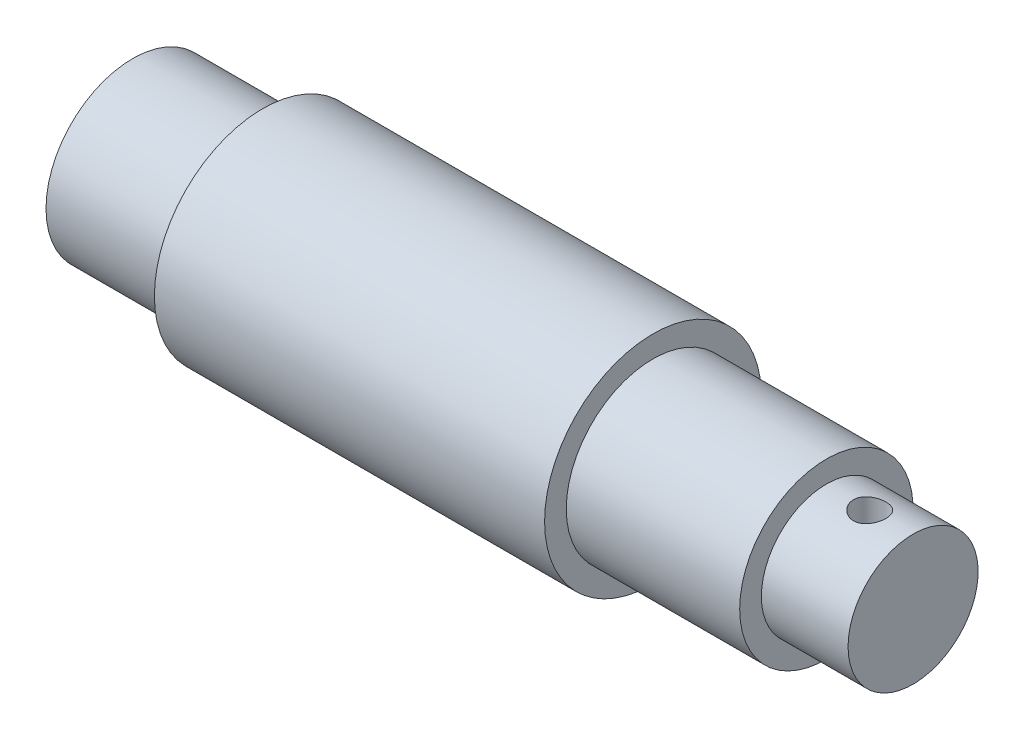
ISO-10303-21;
HEADER;
FILE_DESCRIPTION(('STEP AP214'),'2;1');
FILE_NAME('part.step','',(''),(''),'','','');
FILE_SCHEMA(('AUTOMOTIVE_DESIGN { 1 0 10303 214 1 1 1 1 }'));
ENDSEC;
DATA;
#1=APPLICATION_CONTEXT('core data for automotive mechanical design processes');
#2=APPLICATION_PROTOCOL_DEFINITION('international standard','automotive_design',2000,#1);
#3=PRODUCT_CONTEXT('',#1,'mechanical');
#4=PRODUCT('Part','Part','',(#3));
#5=PRODUCT_RELATED_PRODUCT_CATEGORY('part','',(#4));
#6=PRODUCT_DEFINITION_FORMATION('','',#4);
#7=PRODUCT_DEFINITION_CONTEXT('part definition',#1,'design');
#8=PRODUCT_DEFINITION('design','',#6,#7);
#9=PRODUCT_DEFINITION_SHAPE('','',#8);
#10=(LENGTH_UNIT() NAMED_UNIT(*) SI_UNIT(.MILLI.,.METRE.));
#11=(NAMED_UNIT(*) PLANE_ANGLE_UNIT() SI_UNIT($,.RADIAN.));
#12=(NAMED_UNIT(*) SI_UNIT($,.STERADIAN.) SOLID_ANGLE_UNIT());
#13=UNCERTAINTY_MEASURE_WITH_UNIT(LENGTH_MEASURE(1.E-05),#10,'distance_accuracy_value','');
#14=(GEOMETRIC_REPRESENTATION_CONTEXT(3) GLOBAL_UNCERTAINTY_ASSIGNED_CONTEXT((#13)) GLOBAL_UNIT_ASSIGNED_CONTEXT((#10,
#11,#12)) REPRESENTATION_CONTEXT('',''));
#15=CARTESIAN_POINT('',(0.,0.,0.));
#16=DIRECTION('',(0.,0.,1.));
#17=DIRECTION('',(1.,0.,0.));
#18=AXIS2_PLACEMENT_3D('',#15,#16,#17);
#19=CARTESIAN_POINT('',(0.,0.,0.));
#20=DIRECTION('',(1.,0.,0.));
#21=DIRECTION('',(0.,0.,-1.));
#22=AXIS2_PLACEMENT_3D('',#19,#20,#21);
#23=PLANE('',#22);
#24=CARTESIAN_POINT('',(0.,0.,0.));
#25=DIRECTION('',(-1.,0.,0.));
#26=DIRECTION('',(0.,0.,1.));
#27=AXIS2_PLACEMENT_3D('',#24,#25,#26);
#28=CIRCLE('',#27,6.35);
#29=CARTESIAN_POINT('',(0.,0.,6.35));
#30=VERTEX_POINT('',#29);
#31=EDGE_CURVE('E10',#30,#30,#28,.T.);
#32=ORIENTED_EDGE('',*,*,#31,.T.);
#33=EDGE_LOOP('',(#32));
#34=FACE_BOUND('',#33,.T.);
#35=ADVANCED_FACE('F32',(#34),#23,.F.);
#36=CARTESIAN_POINT('',(0.,0.,0.));
#37=DIRECTION('',(-1.,0.,0.));
#38=DIRECTION('',(0.,0.,1.));
#39=AXIS2_PLACEMENT_3D('',#36,#37,#38);
#40=CYLINDRICAL_SURFACE('',#39,6.35);
#41=ORIENTED_EDGE('',*,*,#31,.F.);
#42=EDGE_LOOP('',(#41));
#43=FACE_BOUND('',#42,.T.);
#44=CARTESIAN_POINT('',(9.525,0.,0.));
#45=DIRECTION('',(-1.,0.,0.));
#46=DIRECTION('',(0.,0.,1.));
#47=AXIS2_PLACEMENT_3D('',#44,#45,#46);
#48=CIRCLE('',#47,6.35);
#49=CARTESIAN_POINT('',(9.525,0.,6.35));
#50=VERTEX_POINT('',#49);
#51=EDGE_CURVE('E43',#50,#50,#48,.T.);
#52=ORIENTED_EDGE('',*,*,#51,.T.);
#53=EDGE_LOOP('',(#52));
#54=FACE_BOUND('',#53,.T.);
#55=ADVANCED_FACE('F74',(#43,#54),#40,.T.);
#56=CARTESIAN_POINT('',(9.525,7.93749999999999,0.));
#57=DIRECTION('',(1.,0.,0.));
#58=DIRECTION('',(0.,0.,-1.));
#59=AXIS2_PLACEMENT_3D('',#56,#57,#58);
#60=PLANE('',#59);
#61=ORIENTED_EDGE('',*,*,#51,.F.);
#62=EDGE_LOOP('',(#61));
#63=FACE_BOUND('',#62,.T.);
#64=CARTESIAN_POINT('',(9.525,0.,0.));
#65=DIRECTION('',(-1.,0.,0.));
#66=DIRECTION('',(0.,0.,1.));
#67=AXIS2_PLACEMENT_3D('',#64,#65,#66);
#68=CIRCLE('',#67,7.93749999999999);
#69=CARTESIAN_POINT('',(9.525,0.,7.93749999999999));
#70=VERTEX_POINT('',#69);
#71=EDGE_CURVE('E48',#70,#70,#68,.T.);
#72=ORIENTED_EDGE('',*,*,#71,.T.);
#73=EDGE_LOOP('',(#72));
#74=FACE_BOUND('',#73,.T.);
#75=ADVANCED_FACE('F78',(#63,#74),#60,.F.);
#76=CARTESIAN_POINT('',(0.,0.,0.));
#77=DIRECTION('',(-1.,0.,0.));
#78=DIRECTION('',(0.,0.,1.));
#79=AXIS2_PLACEMENT_3D('',#76,#77,#78);
#80=CYLINDRICAL_SURFACE('',#79,7.9375);
#81=ORIENTED_EDGE('',*,*,#71,.F.);
#82=EDGE_LOOP('',(#81));
#83=FACE_BOUND('',#82,.T.);
#84=CARTESIAN_POINT('',(38.1,0.,0.));
#85=DIRECTION('',(-1.,0.,0.));
#86=DIRECTION('',(0.,0.,1.));
#87=AXIS2_PLACEMENT_3D('',#84,#85,#86);
#88=CIRCLE('',#87,7.9375);
#89=CARTESIAN_POINT('',(38.1,0.,7.9375));
#90=VERTEX_POINT('',#89);
#91=EDGE_CURVE('E119',#90,#90,#88,.T.);
#92=ORIENTED_EDGE('',*,*,#91,.T.);
#93=EDGE_LOOP('',(#92));
#94=FACE_BOUND('',#93,.T.);
#95=ADVANCED_FACE('F83',(#83,#94),#80,.T.);
#96=CARTESIAN_POINT('',(38.1,6.35,0.));
#97=DIRECTION('',(-1.,0.,0.));
#98=DIRECTION('',(0.,0.,1.));
#99=AXIS2_PLACEMENT_3D('',#96,#97,#98);
#100=PLANE('',#99);
#101=ORIENTED_EDGE('',*,*,#91,.F.);
#102=EDGE_LOOP('',(#101));
#103=FACE_BOUND('',#102,.T.);
#104=CARTESIAN_POINT('',(38.1,0.,0.));
#105=DIRECTION('',(-1.,0.,0.));
#106=DIRECTION('',(0.,0.,1.));
#107=AXIS2_PLACEMENT_3D('',#104,#105,#106);
#108=CIRCLE('',#107,6.35);
#109=CARTESIAN_POINT('',(38.1,0.,6.35));
#110=VERTEX_POINT('',#109);
#111=EDGE_CURVE('E112',#110,#110,#108,.T.);
#112=ORIENTED_EDGE('',*,*,#111,.T.);
#113=EDGE_LOOP('',(#112));
#114=FACE_BOUND('',#113,.T.);
#115=ADVANCED_FACE('F90',(#103,#114),#100,.F.);
#116=CARTESIAN_POINT('',(0.,0.,0.));
#117=DIRECTION('',(-1.,0.,0.));
#118=DIRECTION('',(0.,0.,1.));
#119=AXIS2_PLACEMENT_3D('',#116,#117,#118);
#120=CYLINDRICAL_SURFACE('',#119,6.35);
#121=ORIENTED_EDGE('',*,*,#111,.F.);
#122=EDGE_LOOP('',(#121));
#123=FACE_BOUND('',#122,.T.);
#124=CARTESIAN_POINT('',(50.8,0.,0.));
#125=DIRECTION('',(-1.,0.,0.));
#126=DIRECTION('',(0.,0.,1.));
#127=AXIS2_PLACEMENT_3D('',#124,#125,#126);
#128=CIRCLE('',#127,6.35);
#129=CARTESIAN_POINT('',(50.8,0.,6.35));
#130=VERTEX_POINT('',#129);
#131=EDGE_CURVE('E105',#130,#130,#128,.T.);
#132=ORIENTED_EDGE('',*,*,#131,.T.);
#133=EDGE_LOOP('',(#132));
#134=FACE_BOUND('',#133,.T.);
#135=ADVANCED_FACE('F94',(#123,#134),#120,.T.);
#136=CARTESIAN_POINT('',(50.8,6.35,0.));
#137=DIRECTION('',(-1.,0.,0.));
#138=DIRECTION('',(0.,0.,1.));
#139=AXIS2_PLACEMENT_3D('',#136,#137,#138);
#140=PLANE('',#139);
#141=ORIENTED_EDGE('',*,*,#131,.F.);
#142=EDGE_LOOP('',(#141));
#143=FACE_BOUND('',#142,.T.);
#144=CARTESIAN_POINT('',(50.8,0.,0.));
#145=DIRECTION('',(-1.,0.,0.));
#146=DIRECTION('',(0.,0.,1.));
#147=AXIS2_PLACEMENT_3D('',#144,#145,#146);
#148=CIRCLE('',#147,4.7625);
#149=CARTESIAN_POINT('',(50.8,0.,4.7625));
#150=VERTEX_POINT('',#149);
#151=EDGE_CURVE('E108',#150,#150,#148,.T.);
#152=ORIENTED_EDGE('',*,*,#151,.T.);
#153=EDGE_LOOP('',(#152));
#154=FACE_BOUND('',#153,.T.);
#155=ADVANCED_FACE('F70',(#143,#154),#140,.F.);
#156=CARTESIAN_POINT('',(0.,0.,0.));
#157=DIRECTION('',(-1.,0.,0.));
#158=DIRECTION('',(0.,0.,1.));
#159=AXIS2_PLACEMENT_3D('',#156,#157,#158);
#160=CYLINDRICAL_SURFACE('',#159,4.7625);
#161=CARTESIAN_POINT('',(53.975,-4.61127079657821,1.190625));
#162=CARTESIAN_POINT('',(54.0407466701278,-4.61127205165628,1.19062313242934));
#163=CARTESIAN_POINT('',(54.1065140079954,-4.61269225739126,1.18516062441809));
#164=CARTESIAN_POINT('',(54.2361600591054,-4.61820511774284,1.1634897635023));
#165=CARTESIAN_POINT('',(54.3000376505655,-4.62229932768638,1.14727515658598));
#166=CARTESIAN_POINT('',(54.4240101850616,-4.63266817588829,1.10465768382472));
#167=CARTESIAN_POINT('',(54.4841098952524,-4.63893999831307,1.0782679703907));
#168=CARTESIAN_POINT('',(54.5990355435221,-4.6529538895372,1.01608944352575));
#169=CARTESIAN_POINT('',(54.6538612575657,-4.66069602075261,0.980300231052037));
#170=CARTESIAN_POINT('',(54.7578891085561,-4.6769689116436,0.899497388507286));
#171=CARTESIAN_POINT('',(54.8069580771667,-4.68551227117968,0.85431481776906));
#172=CARTESIAN_POINT('',(54.8969063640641,-4.7023156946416,0.756371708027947));
#173=CARTESIAN_POINT('',(54.9377849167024,-4.71057573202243,0.703610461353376));
#174=CARTESIAN_POINT('',(55.0107368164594,-4.72602122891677,0.591095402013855));
#175=CARTESIAN_POINT('',(55.0426793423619,-4.73319008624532,0.531254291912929));
#176=CARTESIAN_POINT('',(55.0960018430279,-4.7455017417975,0.406842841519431));
#177=CARTESIAN_POINT('',(55.1173833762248,-4.75064483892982,0.342273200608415));
#178=CARTESIAN_POINT('',(55.1485504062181,-4.75823641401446,0.211625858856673));
#179=CARTESIAN_POINT('',(55.1585620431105,-4.76073736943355,0.145605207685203));
#180=CARTESIAN_POINT('',(55.16741492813,-4.76294574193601,0.0127772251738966));
#181=CARTESIAN_POINT('',(55.1662578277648,-4.76265357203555,-0.0540299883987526));
#182=CARTESIAN_POINT('',(55.1529687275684,-4.75934767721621,-0.184966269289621));
#183=CARTESIAN_POINT('',(55.1410808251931,-4.75639448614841,-0.249121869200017));
#184=CARTESIAN_POINT('',(55.1070599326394,-4.74816885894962,-0.374497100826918));
#185=CARTESIAN_POINT('',(55.084926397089,-4.74289629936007,-0.435716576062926));
#186=CARTESIAN_POINT('',(55.0308450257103,-4.73053176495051,-0.554124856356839));
#187=CARTESIAN_POINT('',(54.9988103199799,-4.72342378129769,-0.611272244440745));
#188=CARTESIAN_POINT('',(54.9259018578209,-4.70815941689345,-0.719465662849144));
#189=CARTESIAN_POINT('',(54.885026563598,-4.70000285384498,-0.770510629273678));
#190=CARTESIAN_POINT('',(54.7942887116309,-4.68326968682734,-0.866505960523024));
#191=CARTESIAN_POINT('',(54.7442128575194,-4.67468768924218,-0.911253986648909));
#192=CARTESIAN_POINT('',(54.6371780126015,-4.65827289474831,-0.99176249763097));
#193=CARTESIAN_POINT('',(54.5802187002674,-4.65044013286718,-1.02752256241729));
#194=CARTESIAN_POINT('',(54.4606368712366,-4.63639136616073,-1.08916961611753));
#195=CARTESIAN_POINT('',(54.3979882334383,-4.63018338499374,-1.11500789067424));
#196=CARTESIAN_POINT('',(54.2690436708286,-4.62019002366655,-1.15572256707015));
#197=CARTESIAN_POINT('',(54.202748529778,-4.61640412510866,-1.17060131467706));
#198=CARTESIAN_POINT('',(54.0702692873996,-4.61179238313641,-1.18863886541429));
#199=CARTESIAN_POINT('',(54.0041285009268,-4.6108909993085,-1.19209683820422));
#200=CARTESIAN_POINT('',(53.8722148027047,-4.61194472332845,-1.18801371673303));
#201=CARTESIAN_POINT('',(53.8064418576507,-4.61389956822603,-1.18047363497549));
#202=CARTESIAN_POINT('',(53.6782418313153,-4.62037310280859,-1.15487075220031));
#203=CARTESIAN_POINT('',(53.6157776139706,-4.62484932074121,-1.13698213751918));
#204=CARTESIAN_POINT('',(53.4947345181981,-4.63582092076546,-1.09138311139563));
#205=CARTESIAN_POINT('',(53.4361561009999,-4.64231654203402,-1.0636715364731));
#206=CARTESIAN_POINT('',(53.3232798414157,-4.65675410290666,-0.998587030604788));
#207=CARTESIAN_POINT('',(53.2690885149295,-4.66472191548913,-0.961035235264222));
#208=CARTESIAN_POINT('',(53.1676665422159,-4.68114260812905,-0.877562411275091));
#209=CARTESIAN_POINT('',(53.1204370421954,-4.68959556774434,-0.831640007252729));
#210=CARTESIAN_POINT('',(53.0330674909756,-4.70629013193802,-0.731356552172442));
#211=CARTESIAN_POINT('',(52.9931343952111,-4.71452115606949,-0.676813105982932));
#212=CARTESIAN_POINT('',(52.9229942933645,-4.72962549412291,-0.561621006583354));
#213=CARTESIAN_POINT('',(52.8927867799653,-4.73649887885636,-0.500972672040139));
#214=CARTESIAN_POINT('',(52.8432175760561,-4.74807017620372,-0.375711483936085));
#215=CARTESIAN_POINT('',(52.8237778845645,-4.75278369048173,-0.311131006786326));
#216=CARTESIAN_POINT('',(52.7960620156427,-4.75957245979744,-0.179486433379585));
#217=CARTESIAN_POINT('',(52.7877836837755,-4.76164822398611,-0.112422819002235));
#218=CARTESIAN_POINT('',(52.7827467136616,-4.76290682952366,0.0203400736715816));
#219=CARTESIAN_POINT('',(52.7856826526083,-4.7621663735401,0.0860272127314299));
#220=CARTESIAN_POINT('',(52.8022913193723,-4.7580458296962,0.215940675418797));
#221=CARTESIAN_POINT('',(52.815963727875,-4.75466582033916,0.280167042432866));
#222=CARTESIAN_POINT('',(52.8534934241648,-4.74565780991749,0.405016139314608));
#223=CARTESIAN_POINT('',(52.8772954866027,-4.74004200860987,0.465656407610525));
#224=CARTESIAN_POINT('',(52.9343587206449,-4.72715378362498,0.582116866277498));
#225=CARTESIAN_POINT('',(52.9676210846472,-4.71988115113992,0.637936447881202));
#226=CARTESIAN_POINT('',(53.0435922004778,-4.70424569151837,0.744619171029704));
#227=CARTESIAN_POINT('',(53.0865081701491,-4.69586092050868,0.795331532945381));
#228=CARTESIAN_POINT('',(53.1801659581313,-4.67904491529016,0.888938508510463));
#229=CARTESIAN_POINT('',(53.2309097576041,-4.67061366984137,0.931831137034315));
#230=CARTESIAN_POINT('',(53.3399223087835,-4.65448025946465,1.00936666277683));
#231=CARTESIAN_POINT('',(53.3983137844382,-4.64679463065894,1.04384072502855));
#232=CARTESIAN_POINT('',(53.5202473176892,-4.63324522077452,1.10243171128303));
#233=CARTESIAN_POINT('',(53.5837855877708,-4.6273801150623,1.12655617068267));
#234=CARTESIAN_POINT('',(53.7018432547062,-4.61905241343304,1.16017182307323));
#235=CARTESIAN_POINT('',(53.7557977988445,-4.61615626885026,1.17156686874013));
#236=CARTESIAN_POINT('',(53.8648301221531,-4.61226501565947,1.18679391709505));
#237=CARTESIAN_POINT('',(53.9199078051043,-4.61126974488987,1.19062656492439));
#238=CARTESIAN_POINT('',(53.975,-4.61127079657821,1.190625));
#239=B_SPLINE_CURVE_WITH_KNOTS('',3,(#161,#162,#163,#164,#165,#166,#167,#168,#169,#170,#171,
#172,#173,#174,#175,#176,#177,#178,#179,#180,#181,#182,#183,#184,#185,#186,#187,#188,#189,#190,
#191,#192,#193,#194,#195,#196,#197,#198,#199,#200,#201,#202,#203,#204,#205,#206,#207,#208,#209,
#210,#211,#212,#213,#214,#215,#216,#217,#218,#219,#220,#221,#222,#223,#224,#225,#226,#227,#228,
#229,#230,#231,#232,#233,#234,#235,#236,#237,#238),.UNSPECIFIED.,.T.,.F.,(4,2,2,2,2,2,2,2,2,2,2,
2,2,2,2,2,2,2,2,2,2,2,2,2,2,2,2,2,2,2,2,2,2,2,2,2,2,2,4),(0.,0.197037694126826,0.3941900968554,
0.591088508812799,0.78799528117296,0.988809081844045,1.18964164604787,1.39327650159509,
1.59688129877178,1.79636142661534,1.99581205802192,2.19083697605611,2.3858722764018,
2.5826698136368,2.7795016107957,2.98166059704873,3.18382902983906,3.38697775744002,
3.59008299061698,3.78782377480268,3.98554635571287,4.18003389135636,4.37454447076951,
4.57287080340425,4.77122975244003,4.97455188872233,5.17786341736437,5.37968224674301,
5.5814621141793,5.77778616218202,5.97410437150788,6.16936572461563,6.36465169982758,
6.56461617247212,6.76463133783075,6.96837797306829,7.17197601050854,7.33709715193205,
7.50220420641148),.UNSPECIFIED.);
#240=CARTESIAN_POINT('',(53.975,-4.61127079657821,1.190625));
#241=VERTEX_POINT('',#240);
#242=EDGE_CURVE('E35',#241,#241,#239,.T.);
#243=ORIENTED_EDGE('',*,*,#242,.T.);
#244=EDGE_LOOP('',(#243));
#245=FACE_BOUND('',#244,.T.);
#246=CARTESIAN_POINT('',(53.975,4.61127079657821,1.190625));
#247=CARTESIAN_POINT('',(53.9092533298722,4.61127205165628,1.19062313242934));
#248=CARTESIAN_POINT('',(53.8434859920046,4.61269225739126,1.18516062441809));
#249=CARTESIAN_POINT('',(53.7138399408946,4.61820511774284,1.1634897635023));
#250=CARTESIAN_POINT('',(53.6499623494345,4.62229932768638,1.14727515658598));
#251=CARTESIAN_POINT('',(53.5259898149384,4.63266817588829,1.10465768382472));
#252=CARTESIAN_POINT('',(53.4658901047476,4.63893999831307,1.07826797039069));
#253=CARTESIAN_POINT('',(53.3509644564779,4.6529538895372,1.01608944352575));
#254=CARTESIAN_POINT('',(53.2961387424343,4.66069602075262,0.980300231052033));
#255=CARTESIAN_POINT('',(53.1921108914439,4.6769689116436,0.899497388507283));
#256=CARTESIAN_POINT('',(53.1430419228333,4.68551227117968,0.854314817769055));
#257=CARTESIAN_POINT('',(53.0530936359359,4.7023156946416,0.756371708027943));
#258=CARTESIAN_POINT('',(53.0122150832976,4.71057573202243,0.703610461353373));
#259=CARTESIAN_POINT('',(52.9392631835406,4.72602122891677,0.591095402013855));
#260=CARTESIAN_POINT('',(52.9073206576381,4.73319008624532,0.531254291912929));
#261=CARTESIAN_POINT('',(52.8539981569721,4.7455017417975,0.406842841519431));
#262=CARTESIAN_POINT('',(52.8326166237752,4.75064483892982,0.342273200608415));
#263=CARTESIAN_POINT('',(52.8014495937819,4.75823641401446,0.211625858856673));
#264=CARTESIAN_POINT('',(52.7914379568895,4.76073736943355,0.145605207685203));
#265=CARTESIAN_POINT('',(52.78258507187,4.76294574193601,0.0127772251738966));
#266=CARTESIAN_POINT('',(52.7837421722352,4.76265357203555,-0.0540299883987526));
#267=CARTESIAN_POINT('',(52.7970312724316,4.75934767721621,-0.184966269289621));
#268=CARTESIAN_POINT('',(52.8089191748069,4.75639448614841,-0.249121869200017));
#269=CARTESIAN_POINT('',(52.8429400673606,4.74816885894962,-0.374497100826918));
#270=CARTESIAN_POINT('',(52.865073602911,4.74289629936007,-0.435716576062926));
#271=CARTESIAN_POINT('',(52.9191549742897,4.73053176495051,-0.554124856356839));
#272=CARTESIAN_POINT('',(52.9511896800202,4.72342378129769,-0.611272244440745));
#273=CARTESIAN_POINT('',(53.0240981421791,4.70815941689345,-0.719465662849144));
#274=CARTESIAN_POINT('',(53.064973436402,4.70000285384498,-0.770510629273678));
#275=CARTESIAN_POINT('',(53.1557112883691,4.68326968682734,-0.866505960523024));
#276=CARTESIAN_POINT('',(53.2057871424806,4.67468768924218,-0.911253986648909));
#277=CARTESIAN_POINT('',(53.3128219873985,4.65827289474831,-0.99176249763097));
#278=CARTESIAN_POINT('',(53.3697812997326,4.65044013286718,-1.02752256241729));
#279=CARTESIAN_POINT('',(53.4893631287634,4.63639136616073,-1.08916961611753));
#280=CARTESIAN_POINT('',(53.5520117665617,4.63018338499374,-1.11500789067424));
#281=CARTESIAN_POINT('',(53.6809563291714,4.62019002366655,-1.15572256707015));
#282=CARTESIAN_POINT('',(53.747251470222,4.61640412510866,-1.17060131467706));
#283=CARTESIAN_POINT('',(53.8797307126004,4.61179238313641,-1.18863886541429));
#284=CARTESIAN_POINT('',(53.9458714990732,4.6108909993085,-1.19209683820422));
#285=CARTESIAN_POINT('',(54.0777851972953,4.61194472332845,-1.18801371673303));
#286=CARTESIAN_POINT('',(54.1435581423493,4.61389956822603,-1.18047363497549));
#287=CARTESIAN_POINT('',(54.2717581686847,4.62037310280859,-1.15487075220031));
#288=CARTESIAN_POINT('',(54.3342223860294,4.62484932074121,-1.13698213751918));
#289=CARTESIAN_POINT('',(54.4552654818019,4.63582092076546,-1.09138311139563));
#290=CARTESIAN_POINT('',(54.5138438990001,4.64231654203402,-1.0636715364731));
#291=CARTESIAN_POINT('',(54.6267201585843,4.65675410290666,-0.998587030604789));
#292=CARTESIAN_POINT('',(54.6809114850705,4.66472191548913,-0.961035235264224));
#293=CARTESIAN_POINT('',(54.7823334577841,4.68114260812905,-0.877562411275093));
#294=CARTESIAN_POINT('',(54.8295629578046,4.68959556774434,-0.831640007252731));
#295=CARTESIAN_POINT('',(54.9169325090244,4.70629013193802,-0.731356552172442));
#296=CARTESIAN_POINT('',(54.9568656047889,4.71452115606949,-0.676813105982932));
#297=CARTESIAN_POINT('',(55.0270057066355,4.72962549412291,-0.561621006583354));
#298=CARTESIAN_POINT('',(55.0572132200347,4.73649887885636,-0.500972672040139));
#299=CARTESIAN_POINT('',(55.1067824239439,4.74807017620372,-0.375711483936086));
#300=CARTESIAN_POINT('',(55.1262221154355,4.75278369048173,-0.311131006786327));
#301=CARTESIAN_POINT('',(55.1539379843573,4.75957245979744,-0.179486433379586));
#302=CARTESIAN_POINT('',(55.1622163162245,4.76164822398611,-0.112422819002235));
#303=CARTESIAN_POINT('',(55.1672532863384,4.76290682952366,0.0203400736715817));
#304=CARTESIAN_POINT('',(55.1643173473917,4.7621663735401,0.0860272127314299));
#305=CARTESIAN_POINT('',(55.1477086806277,4.7580458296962,0.215940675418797));
#306=CARTESIAN_POINT('',(55.134036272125,4.75466582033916,0.280167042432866));
#307=CARTESIAN_POINT('',(55.0965065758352,4.74565780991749,0.405016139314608));
#308=CARTESIAN_POINT('',(55.0727045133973,4.74004200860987,0.465656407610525));
#309=CARTESIAN_POINT('',(55.0156412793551,4.72715378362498,0.582116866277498));
#310=CARTESIAN_POINT('',(54.9823789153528,4.71988115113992,0.637936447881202));
#311=CARTESIAN_POINT('',(54.9064077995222,4.70424569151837,0.744619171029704));
#312=CARTESIAN_POINT('',(54.8634918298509,4.69586092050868,0.795331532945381));
#313=CARTESIAN_POINT('',(54.7698340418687,4.67904491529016,0.888938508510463));
#314=CARTESIAN_POINT('',(54.7190902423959,4.67061366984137,0.931831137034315));
#315=CARTESIAN_POINT('',(54.6100776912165,4.65448025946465,1.00936666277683));
#316=CARTESIAN_POINT('',(54.5516862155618,4.64679463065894,1.04384072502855));
#317=CARTESIAN_POINT('',(54.4297526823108,4.63324522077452,1.10243171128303));
#318=CARTESIAN_POINT('',(54.3662144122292,4.6273801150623,1.12655617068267));
#319=CARTESIAN_POINT('',(54.2481567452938,4.61905241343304,1.16017182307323));
#320=CARTESIAN_POINT('',(54.1942022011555,4.61615626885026,1.17156686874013));
#321=CARTESIAN_POINT('',(54.0851698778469,4.61226501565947,1.18679391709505));
#322=CARTESIAN_POINT('',(54.0300921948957,4.61126974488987,1.19062656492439));
#323=CARTESIAN_POINT('',(53.975,4.61127079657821,1.190625));
#324=B_SPLINE_CURVE_WITH_KNOTS('',3,(#246,#247,#248,#249,#250,#251,#252,#253,#254,#255,#256,
#257,#258,#259,#260,#261,#262,#263,#264,#265,#266,#267,#268,#269,#270,#271,#272,#273,#274,#275,
#276,#277,#278,#279,#280,#281,#282,#283,#284,#285,#286,#287,#288,#289,#290,#291,#292,#293,#294,
#295,#296,#297,#298,#299,#300,#301,#302,#303,#304,#305,#306,#307,#308,#309,#310,#311,#312,#313,
#314,#315,#316,#317,#318,#319,#320,#321,#322,#323),.UNSPECIFIED.,.T.,.F.,(4,2,2,2,2,2,2,2,2,2,2,
2,2,2,2,2,2,2,2,2,2,2,2,2,2,2,2,2,2,2,2,2,2,2,2,2,2,2,4),(0.,0.197037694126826,0.3941900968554,
0.591088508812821,0.78799528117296,0.988809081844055,1.18964164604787,1.39327650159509,
1.59688129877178,1.79636142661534,1.99581205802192,2.19083697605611,2.3858722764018,
2.5826698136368,2.7795016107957,2.98166059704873,3.18382902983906,3.38697775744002,
3.59008299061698,3.78782377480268,3.98554635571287,4.18003389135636,4.37454447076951,
4.57287080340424,4.77122975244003,4.97455188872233,5.17786341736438,5.37968224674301,
5.5814621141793,5.77778616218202,5.97410437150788,6.16936572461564,6.36465169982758,
6.56461617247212,6.76463133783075,6.96837797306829,7.17197601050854,7.33709715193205,
7.50220420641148),.UNSPECIFIED.);
#325=CARTESIAN_POINT('',(53.975,4.61127079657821,1.190625));
#326=VERTEX_POINT('',#325);
#327=EDGE_CURVE('E51',#326,#326,#324,.T.);
#328=ORIENTED_EDGE('',*,*,#327,.T.);
#329=EDGE_LOOP('',(#328));
#330=FACE_BOUND('',#329,.T.);
#331=ORIENTED_EDGE('',*,*,#151,.F.);
#332=EDGE_LOOP('',(#331));
#333=FACE_BOUND('',#332,.T.);
#334=CARTESIAN_POINT('',(57.15,0.,0.));
#335=DIRECTION('',(-1.,0.,0.));
#336=DIRECTION('',(0.,0.,1.));
#337=AXIS2_PLACEMENT_3D('',#334,#335,#336);
#338=CIRCLE('',#337,4.7625);
#339=CARTESIAN_POINT('',(57.15,0.,4.7625));
#340=VERTEX_POINT('',#339);
#341=EDGE_CURVE('E110',#340,#340,#338,.T.);
#342=ORIENTED_EDGE('',*,*,#341,.T.);
#343=EDGE_LOOP('',(#342));
#344=FACE_BOUND('',#343,.T.);
#345=ADVANCED_FACE('F55',(#245,#330,#333,#344),#160,.T.);
#346=CARTESIAN_POINT('',(57.15,4.7625,0.));
#347=DIRECTION('',(-1.,0.,0.));
#348=DIRECTION('',(0.,0.,1.));
#349=AXIS2_PLACEMENT_3D('',#346,#347,#348);
#350=PLANE('',#349);
#351=ORIENTED_EDGE('',*,*,#341,.F.);
#352=EDGE_LOOP('',(#351));
#353=FACE_BOUND('',#352,.T.);
#354=ADVANCED_FACE('F62',(#353),#350,.F.);
#355=CARTESIAN_POINT('',(53.975,-7.9375,0.));
#356=DIRECTION('',(0.,1.,0.));
#357=DIRECTION('',(0.,0.,1.));
#358=AXIS2_PLACEMENT_3D('',#355,#356,#357);
#359=CYLINDRICAL_SURFACE('',#358,1.190625);
#360=ORIENTED_EDGE('',*,*,#327,.F.);
#361=EDGE_LOOP('',(#360));
#362=FACE_BOUND('',#361,.T.);
#363=ORIENTED_EDGE('',*,*,#242,.F.);
#364=EDGE_LOOP('',(#363));
#365=FACE_BOUND('',#364,.T.);
#366=ADVANCED_FACE('F59',(#362,#365),#359,.F.);
#367=CLOSED_SHELL('',(#35,#55,#75,#95,#115,#135,#155,#345,#354,#366));
#368=MANIFOLD_SOLID_BREP('B2',#367);
#369=ADVANCED_BREP_SHAPE_REPRESENTATION('',(#18,#368),#14);
#370=SHAPE_DEFINITION_REPRESENTATION(#9,#369);
ENDSEC;
END-ISO-10303-21;
